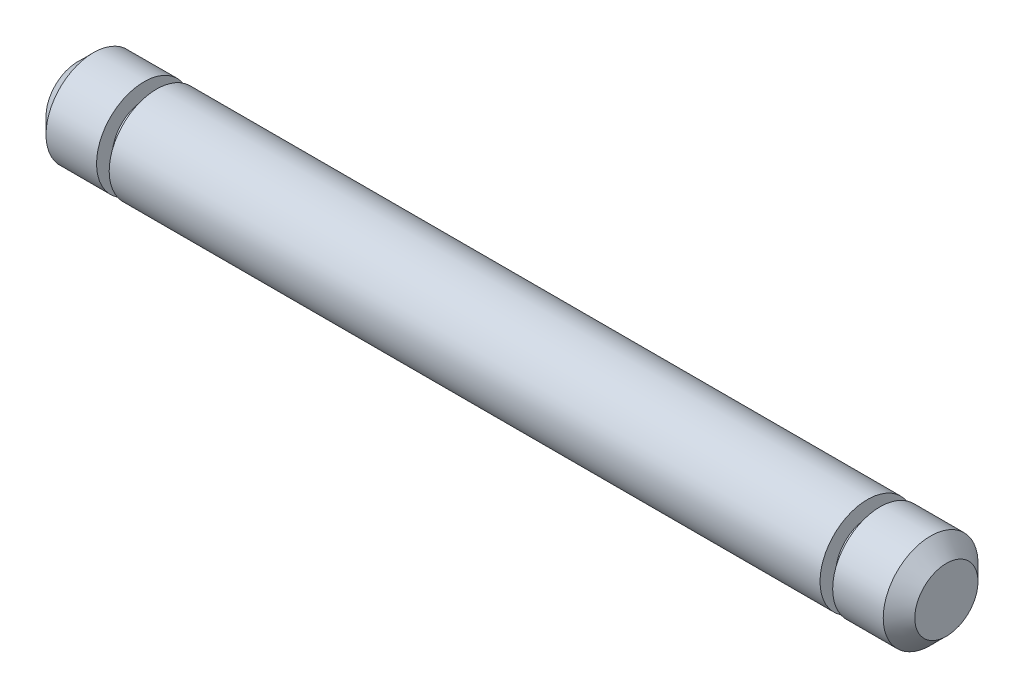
ISO-10303-21;
HEADER;
FILE_DESCRIPTION(('STEP AP214'),'2;1');
FILE_NAME('part.step','',(''),(''),'','','');
FILE_SCHEMA(('AUTOMOTIVE_DESIGN { 1 0 10303 214 1 1 1 1 }'));
ENDSEC;
DATA;
#1=APPLICATION_CONTEXT('core data for automotive mechanical design processes');
#2=APPLICATION_PROTOCOL_DEFINITION('international standard','automotive_design',2000,#1);
#3=PRODUCT_CONTEXT('',#1,'mechanical');
#4=PRODUCT('Part','Part','',(#3));
#5=PRODUCT_RELATED_PRODUCT_CATEGORY('part','',(#4));
#6=PRODUCT_DEFINITION_FORMATION('','',#4);
#7=PRODUCT_DEFINITION_CONTEXT('part definition',#1,'design');
#8=PRODUCT_DEFINITION('design','',#6,#7);
#9=PRODUCT_DEFINITION_SHAPE('','',#8);
#10=(LENGTH_UNIT() NAMED_UNIT(*) SI_UNIT(.MILLI.,.METRE.));
#11=(NAMED_UNIT(*) PLANE_ANGLE_UNIT() SI_UNIT($,.RADIAN.));
#12=(NAMED_UNIT(*) SI_UNIT($,.STERADIAN.) SOLID_ANGLE_UNIT());
#13=UNCERTAINTY_MEASURE_WITH_UNIT(LENGTH_MEASURE(1.E-05),#10,'distance_accuracy_value','');
#14=(GEOMETRIC_REPRESENTATION_CONTEXT(3) GLOBAL_UNCERTAINTY_ASSIGNED_CONTEXT((#13)) GLOBAL_UNIT_ASSIGNED_CONTEXT((#10,
#11,#12)) REPRESENTATION_CONTEXT('',''));
#15=CARTESIAN_POINT('',(0.,0.,0.));
#16=DIRECTION('',(0.,0.,1.));
#17=DIRECTION('',(1.,0.,0.));
#18=AXIS2_PLACEMENT_3D('',#15,#16,#17);
#19=CARTESIAN_POINT('',(-0.840614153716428,0.,0.));
#20=DIRECTION('',(-1.,0.,0.));
#21=DIRECTION('',(0.,0.,1.));
#22=AXIS2_PLACEMENT_3D('',#19,#20,#21);
#23=CYLINDRICAL_SURFACE('',#22,1.5);
#24=CARTESIAN_POINT('',(11.25,0.,0.));
#25=DIRECTION('',(-1.,0.,0.));
#26=DIRECTION('',(0.,0.,1.));
#27=AXIS2_PLACEMENT_3D('',#24,#25,#26);
#28=CIRCLE('',#27,1.5);
#29=CARTESIAN_POINT('',(11.25,0.,1.5));
#30=VERTEX_POINT('',#29);
#31=EDGE_CURVE('E367',#30,#30,#28,.T.);
#32=ORIENTED_EDGE('',*,*,#31,.T.);
#33=EDGE_LOOP('',(#32));
#34=FACE_BOUND('',#33,.T.);
#35=CARTESIAN_POINT('',(-11.25,0.,0.));
#36=DIRECTION('',(-1.,0.,0.));
#37=DIRECTION('',(0.,0.,1.));
#38=AXIS2_PLACEMENT_3D('',#35,#36,#37);
#39=CIRCLE('',#38,1.5);
#40=CARTESIAN_POINT('',(-11.25,0.,1.5));
#41=VERTEX_POINT('',#40);
#42=EDGE_CURVE('E379',#41,#41,#39,.T.);
#43=ORIENTED_EDGE('',*,*,#42,.F.);
#44=EDGE_LOOP('',(#43));
#45=FACE_BOUND('',#44,.T.);
#46=ADVANCED_FACE('F348',(#34,#45),#23,.T.);
#47=CARTESIAN_POINT('',(11.25,1.5,0.));
#48=DIRECTION('',(-1.,0.,0.));
#49=DIRECTION('',(0.,0.,1.));
#50=AXIS2_PLACEMENT_3D('',#47,#48,#49);
#51=PLANE('',#50);
#52=ORIENTED_EDGE('',*,*,#31,.F.);
#53=EDGE_LOOP('',(#52));
#54=FACE_BOUND('',#53,.T.);
#55=CARTESIAN_POINT('',(11.25,0.,0.));
#56=DIRECTION('',(-1.,0.,0.));
#57=DIRECTION('',(0.,0.,1.));
#58=AXIS2_PLACEMENT_3D('',#55,#56,#57);
#59=CIRCLE('',#58,1.);
#60=CARTESIAN_POINT('',(11.25,0.,1.));
#61=VERTEX_POINT('',#60);
#62=EDGE_CURVE('E370',#61,#61,#59,.T.);
#63=ORIENTED_EDGE('',*,*,#62,.T.);
#64=EDGE_LOOP('',(#63));
#65=FACE_BOUND('',#64,.T.);
#66=ADVANCED_FACE('F409',(#54,#65),#51,.F.);
#67=CARTESIAN_POINT('',(-0.840614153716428,0.,0.));
#68=DIRECTION('',(-1.,0.,0.));
#69=DIRECTION('',(0.,0.,1.));
#70=AXIS2_PLACEMENT_3D('',#67,#68,#69);
#71=CYLINDRICAL_SURFACE('',#70,1.);
#72=ORIENTED_EDGE('',*,*,#62,.F.);
#73=EDGE_LOOP('',(#72));
#74=FACE_BOUND('',#73,.T.);
#75=CARTESIAN_POINT('',(11.65,0.,0.));
#76=DIRECTION('',(-1.,0.,0.));
#77=DIRECTION('',(0.,0.,1.));
#78=AXIS2_PLACEMENT_3D('',#75,#76,#77);
#79=CIRCLE('',#78,1.);
#80=CARTESIAN_POINT('',(11.65,0.,1.));
#81=VERTEX_POINT('',#80);
#82=EDGE_CURVE('E373',#81,#81,#79,.T.);
#83=ORIENTED_EDGE('',*,*,#82,.T.);
#84=EDGE_LOOP('',(#83));
#85=FACE_BOUND('',#84,.T.);
#86=ADVANCED_FACE('F414',(#74,#85),#71,.T.);
#87=CARTESIAN_POINT('',(11.65,1.5,0.));
#88=DIRECTION('',(1.,0.,0.));
#89=DIRECTION('',(0.,0.,-1.));
#90=AXIS2_PLACEMENT_3D('',#87,#88,#89);
#91=PLANE('',#90);
#92=ORIENTED_EDGE('',*,*,#82,.F.);
#93=EDGE_LOOP('',(#92));
#94=FACE_BOUND('',#93,.T.);
#95=CARTESIAN_POINT('',(11.65,0.,0.));
#96=DIRECTION('',(-1.,0.,0.));
#97=DIRECTION('',(0.,0.,1.));
#98=AXIS2_PLACEMENT_3D('',#95,#96,#97);
#99=CIRCLE('',#98,1.5);
#100=CARTESIAN_POINT('',(11.65,0.,1.5));
#101=VERTEX_POINT('',#100);
#102=EDGE_CURVE('E376',#101,#101,#99,.T.);
#103=ORIENTED_EDGE('',*,*,#102,.T.);
#104=EDGE_LOOP('',(#103));
#105=FACE_BOUND('',#104,.T.);
#106=ADVANCED_FACE('F440',(#94,#105),#91,.F.);
#107=CARTESIAN_POINT('',(-0.840614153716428,0.,0.));
#108=DIRECTION('',(-1.,0.,0.));
#109=DIRECTION('',(0.,0.,1.));
#110=AXIS2_PLACEMENT_3D('',#107,#108,#109);
#111=CYLINDRICAL_SURFACE('',#110,1.5);
#112=CARTESIAN_POINT('',(13.25,0.,0.));
#113=DIRECTION('',(-1.,0.,0.));
#114=DIRECTION('',(0.,0.,1.));
#115=AXIS2_PLACEMENT_3D('',#112,#113,#114);
#116=CIRCLE('',#115,1.5);
#117=CARTESIAN_POINT('',(13.25,0.,1.5));
#118=VERTEX_POINT('',#117);
#119=EDGE_CURVE('E362',#118,#118,#116,.T.);
#120=ORIENTED_EDGE('',*,*,#119,.T.);
#121=EDGE_LOOP('',(#120));
#122=FACE_BOUND('',#121,.T.);
#123=ORIENTED_EDGE('',*,*,#102,.F.);
#124=EDGE_LOOP('',(#123));
#125=FACE_BOUND('',#124,.T.);
#126=ADVANCED_FACE('F436',(#122,#125),#111,.T.);
#127=CARTESIAN_POINT('',(13.75,0.,0.));
#128=DIRECTION('',(-1.,0.,0.));
#129=DIRECTION('',(0.,0.,1.));
#130=AXIS2_PLACEMENT_3D('',#127,#128,#129);
#131=PLANE('',#130);
#132=CARTESIAN_POINT('',(13.75,0.,0.));
#133=DIRECTION('',(-1.,0.,0.));
#134=DIRECTION('',(0.,0.,1.));
#135=AXIS2_PLACEMENT_3D('',#132,#133,#134);
#136=CIRCLE('',#135,1.);
#137=CARTESIAN_POINT('',(13.75,0.,1.));
#138=VERTEX_POINT('',#137);
#139=EDGE_CURVE('E358',#138,#138,#136,.F.);
#140=ORIENTED_EDGE('',*,*,#139,.T.);
#141=EDGE_LOOP('',(#140));
#142=FACE_BOUND('',#141,.T.);
#143=ADVANCED_FACE('F430',(#142),#131,.F.);
#144=CARTESIAN_POINT('',(13.25,0.,0.));
#145=DIRECTION('',(-1.,0.,0.));
#146=DIRECTION('',(0.,0.,1.));
#147=AXIS2_PLACEMENT_3D('',#144,#145,#146);
#148=CONICAL_SURFACE('',#147,1.5,0.785398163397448);
#149=ORIENTED_EDGE('',*,*,#139,.F.);
#150=EDGE_LOOP('',(#149));
#151=FACE_BOUND('',#150,.T.);
#152=ORIENTED_EDGE('',*,*,#119,.F.);
#153=EDGE_LOOP('',(#152));
#154=FACE_BOUND('',#153,.T.);
#155=ADVANCED_FACE('F422',(#151,#154),#148,.T.);
#156=CARTESIAN_POINT('',(-11.25,1.5,0.));
#157=DIRECTION('',(1.,0.,0.));
#158=DIRECTION('',(0.,0.,1.));
#159=AXIS2_PLACEMENT_3D('',#156,#157,#158);
#160=PLANE('',#159);
#161=ORIENTED_EDGE('',*,*,#42,.T.);
#162=EDGE_LOOP('',(#161));
#163=FACE_BOUND('',#162,.T.);
#164=CARTESIAN_POINT('',(-11.25,0.,0.));
#165=DIRECTION('',(-1.,0.,0.));
#166=DIRECTION('',(0.,0.,1.));
#167=AXIS2_PLACEMENT_3D('',#164,#165,#166);
#168=CIRCLE('',#167,1.);
#169=CARTESIAN_POINT('',(-11.25,0.,1.));
#170=VERTEX_POINT('',#169);
#171=EDGE_CURVE('E382',#170,#170,#168,.T.);
#172=ORIENTED_EDGE('',*,*,#171,.F.);
#173=EDGE_LOOP('',(#172));
#174=FACE_BOUND('',#173,.T.);
#175=ADVANCED_FACE('F405',(#163,#174),#160,.F.);
#176=CARTESIAN_POINT('',(0.840614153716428,0.,0.));
#177=DIRECTION('',(1.,0.,0.));
#178=DIRECTION('',(0.,0.,1.));
#179=AXIS2_PLACEMENT_3D('',#176,#177,#178);
#180=CYLINDRICAL_SURFACE('',#179,1.);
#181=ORIENTED_EDGE('',*,*,#171,.T.);
#182=EDGE_LOOP('',(#181));
#183=FACE_BOUND('',#182,.T.);
#184=CARTESIAN_POINT('',(-11.65,0.,0.));
#185=DIRECTION('',(-1.,0.,0.));
#186=DIRECTION('',(0.,0.,1.));
#187=AXIS2_PLACEMENT_3D('',#184,#185,#186);
#188=CIRCLE('',#187,1.);
#189=CARTESIAN_POINT('',(-11.65,0.,1.));
#190=VERTEX_POINT('',#189);
#191=EDGE_CURVE('E385',#190,#190,#188,.T.);
#192=ORIENTED_EDGE('',*,*,#191,.F.);
#193=EDGE_LOOP('',(#192));
#194=FACE_BOUND('',#193,.T.);
#195=ADVANCED_FACE('F396',(#183,#194),#180,.T.);
#196=CARTESIAN_POINT('',(-11.65,1.5,0.));
#197=DIRECTION('',(-1.,0.,0.));
#198=DIRECTION('',(0.,0.,-1.));
#199=AXIS2_PLACEMENT_3D('',#196,#197,#198);
#200=PLANE('',#199);
#201=ORIENTED_EDGE('',*,*,#191,.T.);
#202=EDGE_LOOP('',(#201));
#203=FACE_BOUND('',#202,.T.);
#204=CARTESIAN_POINT('',(-11.65,0.,0.));
#205=DIRECTION('',(-1.,0.,0.));
#206=DIRECTION('',(0.,0.,1.));
#207=AXIS2_PLACEMENT_3D('',#204,#205,#206);
#208=CIRCLE('',#207,1.5);
#209=CARTESIAN_POINT('',(-11.65,0.,1.5));
#210=VERTEX_POINT('',#209);
#211=EDGE_CURVE('E388',#210,#210,#208,.T.);
#212=ORIENTED_EDGE('',*,*,#211,.F.);
#213=EDGE_LOOP('',(#212));
#214=FACE_BOUND('',#213,.T.);
#215=ADVANCED_FACE('F394',(#203,#214),#200,.F.);
#216=CARTESIAN_POINT('',(0.840614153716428,0.,0.));
#217=DIRECTION('',(1.,0.,0.));
#218=DIRECTION('',(0.,0.,1.));
#219=AXIS2_PLACEMENT_3D('',#216,#217,#218);
#220=CYLINDRICAL_SURFACE('',#219,1.5);
#221=CARTESIAN_POINT('',(-13.25,0.,0.));
#222=DIRECTION('',(1.,0.,0.));
#223=DIRECTION('',(0.,0.,-1.));
#224=AXIS2_PLACEMENT_3D('',#221,#222,#223);
#225=CIRCLE('',#224,1.5);
#226=CARTESIAN_POINT('',(-13.25,0.,-1.5));
#227=VERTEX_POINT('',#226);
#228=EDGE_CURVE('E10',#227,#227,#225,.T.);
#229=ORIENTED_EDGE('',*,*,#228,.T.);
#230=EDGE_LOOP('',(#229));
#231=FACE_BOUND('',#230,.T.);
#232=ORIENTED_EDGE('',*,*,#211,.T.);
#233=EDGE_LOOP('',(#232));
#234=FACE_BOUND('',#233,.T.);
#235=ADVANCED_FACE('F392',(#231,#234),#220,.T.);
#236=CARTESIAN_POINT('',(-13.75,0.,0.));
#237=DIRECTION('',(1.,0.,0.));
#238=DIRECTION('',(0.,0.,1.));
#239=AXIS2_PLACEMENT_3D('',#236,#237,#238);
#240=PLANE('',#239);
#241=CARTESIAN_POINT('',(-13.75,0.,0.));
#242=DIRECTION('',(1.,0.,0.));
#243=DIRECTION('',(0.,0.,-1.));
#244=AXIS2_PLACEMENT_3D('',#241,#242,#243);
#245=CIRCLE('',#244,1.);
#246=CARTESIAN_POINT('',(-13.75,0.,-1.));
#247=VERTEX_POINT('',#246);
#248=EDGE_CURVE('E354',#247,#247,#245,.F.);
#249=ORIENTED_EDGE('',*,*,#248,.T.);
#250=EDGE_LOOP('',(#249));
#251=FACE_BOUND('',#250,.T.);
#252=ADVANCED_FACE('F403',(#251),#240,.F.);
#253=CARTESIAN_POINT('',(-13.75,0.,0.));
#254=DIRECTION('',(1.,0.,0.));
#255=DIRECTION('',(0.,0.,-1.));
#256=AXIS2_PLACEMENT_3D('',#253,#254,#255);
#257=CONICAL_SURFACE('',#256,1.,0.785398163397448);
#258=ORIENTED_EDGE('',*,*,#228,.F.);
#259=EDGE_LOOP('',(#258));
#260=FACE_BOUND('',#259,.T.);
#261=ORIENTED_EDGE('',*,*,#248,.F.);
#262=EDGE_LOOP('',(#261));
#263=FACE_BOUND('',#262,.T.);
#264=ADVANCED_FACE('F498',(#260,#263),#257,.T.);
#265=CLOSED_SHELL('',(#46,#66,#86,#106,#126,#143,#155,#175,#195,#215,#235,#252,#264));
#266=MANIFOLD_SOLID_BREP('B2',#265);
#267=ADVANCED_BREP_SHAPE_REPRESENTATION('',(#18,#266),#14);
#268=SHAPE_DEFINITION_REPRESENTATION(#9,#267);
ENDSEC;
END-ISO-10303-21;
